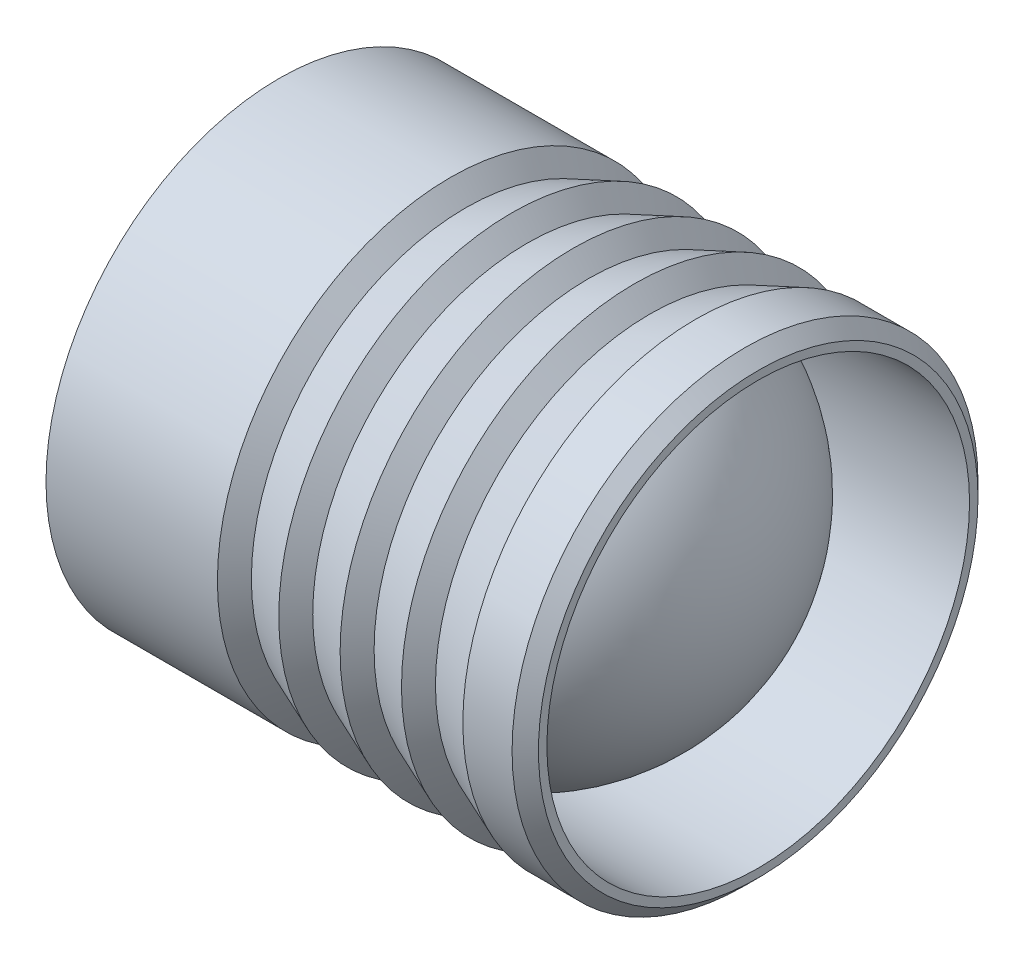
ISO-10303-21;
HEADER;
FILE_DESCRIPTION(('STEP AP214'),'2;1');
FILE_NAME('part.step','',(''),(''),'','','');
FILE_SCHEMA(('AUTOMOTIVE_DESIGN { 1 0 10303 214 1 1 1 1 }'));
ENDSEC;
DATA;
#1=APPLICATION_CONTEXT('core data for automotive mechanical design processes');
#2=APPLICATION_PROTOCOL_DEFINITION('international standard','automotive_design',2000,#1);
#3=PRODUCT_CONTEXT('',#1,'mechanical');
#4=PRODUCT('Part','Part','',(#3));
#5=PRODUCT_RELATED_PRODUCT_CATEGORY('part','',(#4));
#6=PRODUCT_DEFINITION_FORMATION('','',#4);
#7=PRODUCT_DEFINITION_CONTEXT('part definition',#1,'design');
#8=PRODUCT_DEFINITION('design','',#6,#7);
#9=PRODUCT_DEFINITION_SHAPE('','',#8);
#10=(LENGTH_UNIT() NAMED_UNIT(*) SI_UNIT(.MILLI.,.METRE.));
#11=(NAMED_UNIT(*) PLANE_ANGLE_UNIT() SI_UNIT($,.RADIAN.));
#12=(NAMED_UNIT(*) SI_UNIT($,.STERADIAN.) SOLID_ANGLE_UNIT());
#13=UNCERTAINTY_MEASURE_WITH_UNIT(LENGTH_MEASURE(1.E-05),#10,'distance_accuracy_value','');
#14=(GEOMETRIC_REPRESENTATION_CONTEXT(3) GLOBAL_UNCERTAINTY_ASSIGNED_CONTEXT((#13)) GLOBAL_UNIT_ASSIGNED_CONTEXT((#10,
#11,#12)) REPRESENTATION_CONTEXT('',''));
#15=CARTESIAN_POINT('',(0.,0.,0.));
#16=DIRECTION('',(0.,0.,1.));
#17=DIRECTION('',(1.,0.,0.));
#18=AXIS2_PLACEMENT_3D('',#15,#16,#17);
#19=CARTESIAN_POINT('',(8.24,0.,0.));
#20=DIRECTION('',(1.,0.,0.));
#21=DIRECTION('',(0.,1.,0.));
#22=AXIS2_PLACEMENT_3D('',#19,#20,#21);
#23=SPHERICAL_SURFACE('',#22,6.36);
#24=CARTESIAN_POINT('',(8.59651265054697,0.,0.));
#25=DIRECTION('',(-1.,0.,0.));
#26=DIRECTION('',(0.,0.,1.));
#27=AXIS2_PLACEMENT_3D('',#24,#25,#26);
#28=CIRCLE('',#27,6.3499999);
#29=CARTESIAN_POINT('',(8.59651265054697,0.,6.3499999));
#30=VERTEX_POINT('',#29);
#31=EDGE_CURVE('E41',#30,#30,#28,.T.);
#32=ORIENTED_EDGE('',*,*,#31,.F.);
#33=EDGE_LOOP('',(#32));
#34=FACE_BOUND('',#33,.T.);
#35=CARTESIAN_POINT('',(14.6,0.,0.));
#36=VERTEX_POINT('',#35);
#37=VERTEX_LOOP('',#36);
#38=FACE_BOUND('',#37,.T.);
#39=ADVANCED_FACE('F18',(#34,#38),#23,.T.);
#40=CARTESIAN_POINT('',(15.,6.60402020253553,0.));
#41=DIRECTION('',(-1.,0.,0.));
#42=DIRECTION('',(0.,0.,1.));
#43=AXIS2_PLACEMENT_3D('',#40,#41,#42);
#44=PLANE('',#43);
#45=CARTESIAN_POINT('',(15.,0.,0.));
#46=DIRECTION('',(1.,0.,0.));
#47=DIRECTION('',(0.,0.,-1.));
#48=AXIS2_PLACEMENT_3D('',#45,#46,#47);
#49=CIRCLE('',#48,6.6040202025);
#50=CARTESIAN_POINT('',(15.,0.,-6.60402020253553));
#51=VERTEX_POINT('',#50);
#52=EDGE_CURVE('E11',#51,#51,#49,.T.);
#53=ORIENTED_EDGE('',*,*,#52,.T.);
#54=EDGE_LOOP('',(#53));
#55=FACE_BOUND('',#54,.T.);
#56=CARTESIAN_POINT('',(15.,0.,0.));
#57=DIRECTION('',(1.,0.,0.));
#58=DIRECTION('',(0.,0.,-1.));
#59=AXIS2_PLACEMENT_3D('',#56,#57,#58);
#60=CIRCLE('',#59,6.3499999);
#61=CARTESIAN_POINT('',(15.,0.,-6.34999989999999));
#62=VERTEX_POINT('',#61);
#63=EDGE_CURVE('E29',#62,#62,#60,.T.);
#64=ORIENTED_EDGE('',*,*,#63,.F.);
#65=EDGE_LOOP('',(#64));
#66=FACE_BOUND('',#65,.T.);
#67=ADVANCED_FACE('F172',(#55,#66),#44,.F.);
#68=CARTESIAN_POINT('',(15.,0.,0.));
#69=DIRECTION('',(-1.,0.,0.));
#70=DIRECTION('',(0.,0.,-1.));
#71=AXIS2_PLACEMENT_3D('',#68,#69,#70);
#72=CYLINDRICAL_SURFACE('',#71,6.3499999);
#73=ORIENTED_EDGE('',*,*,#63,.T.);
#74=EDGE_LOOP('',(#73));
#75=FACE_BOUND('',#74,.T.);
#76=ORIENTED_EDGE('',*,*,#31,.T.);
#77=EDGE_LOOP('',(#76));
#78=FACE_BOUND('',#77,.T.);
#79=ADVANCED_FACE('F169',(#75,#78),#72,.F.);
#80=CARTESIAN_POINT('',(0.,0.,0.));
#81=DIRECTION('',(1.,0.,0.));
#82=DIRECTION('',(0.,1.,0.));
#83=AXIS2_PLACEMENT_3D('',#80,#81,#82);
#84=PLANE('',#83);
#85=CARTESIAN_POINT('',(0.,0.,0.));
#86=DIRECTION('',(1.,0.,0.));
#87=DIRECTION('',(0.,0.,-1.));
#88=AXIS2_PLACEMENT_3D('',#85,#86,#87);
#89=CIRCLE('',#88,5.9607695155);
#90=CARTESIAN_POINT('',(0.,0.,-5.96076951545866));
#91=VERTEX_POINT('',#90);
#92=EDGE_CURVE('E22',#91,#91,#89,.T.);
#93=ORIENTED_EDGE('',*,*,#92,.F.);
#94=EDGE_LOOP('',(#93));
#95=FACE_BOUND('',#94,.T.);
#96=ADVANCED_FACE('F171',(#95),#84,.F.);
#97=CARTESIAN_POINT('',(14.6040202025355,0.,0.));
#98=DIRECTION('',(-1.,0.,0.));
#99=DIRECTION('',(0.,0.,1.));
#100=AXIS2_PLACEMENT_3D('',#97,#98,#99);
#101=CONICAL_SURFACE('',#100,7.,0.7853981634);
#102=CARTESIAN_POINT('',(14.6040202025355,0.,0.));
#103=DIRECTION('',(1.,0.,0.));
#104=DIRECTION('',(0.,0.,-1.));
#105=AXIS2_PLACEMENT_3D('',#102,#103,#104);
#106=CIRCLE('',#105,7.);
#107=CARTESIAN_POINT('',(14.6040202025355,0.,-7.));
#108=VERTEX_POINT('',#107);
#109=EDGE_CURVE('E112',#108,#108,#106,.T.);
#110=ORIENTED_EDGE('',*,*,#109,.T.);
#111=EDGE_LOOP('',(#110));
#112=FACE_BOUND('',#111,.T.);
#113=ORIENTED_EDGE('',*,*,#52,.F.);
#114=EDGE_LOOP('',(#113));
#115=FACE_BOUND('',#114,.T.);
#116=ADVANCED_FACE('F180',(#112,#115),#101,.T.);
#117=CARTESIAN_POINT('',(15.,0.,0.));
#118=DIRECTION('',(-1.,0.,0.));
#119=DIRECTION('',(0.,0.,-1.));
#120=AXIS2_PLACEMENT_3D('',#117,#118,#119);
#121=CYLINDRICAL_SURFACE('',#120,7.);
#122=CARTESIAN_POINT('',(13.125,0.,0.));
#123=DIRECTION('',(1.,0.,0.));
#124=DIRECTION('',(0.,0.,-1.));
#125=AXIS2_PLACEMENT_3D('',#122,#123,#124);
#126=CIRCLE('',#125,7.);
#127=CARTESIAN_POINT('',(13.125,0.,-7.));
#128=VERTEX_POINT('',#127);
#129=EDGE_CURVE('E107',#128,#128,#126,.T.);
#130=ORIENTED_EDGE('',*,*,#129,.T.);
#131=EDGE_LOOP('',(#130));
#132=FACE_BOUND('',#131,.T.);
#133=ORIENTED_EDGE('',*,*,#109,.F.);
#134=EDGE_LOOP('',(#133));
#135=FACE_BOUND('',#134,.T.);
#136=ADVANCED_FACE('F209',(#132,#135),#121,.T.);
#137=CARTESIAN_POINT('',(11.7421875,0.,0.));
#138=DIRECTION('',(1.,0.,0.));
#139=DIRECTION('',(0.,0.,-1.));
#140=AXIS2_PLACEMENT_3D('',#137,#138,#139);
#141=CONICAL_SURFACE('',#140,6.44,0.3847850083);
#142=ORIENTED_EDGE('',*,*,#129,.F.);
#143=EDGE_LOOP('',(#142));
#144=FACE_BOUND('',#143,.T.);
#145=CARTESIAN_POINT('',(11.7421875,0.,0.));
#146=DIRECTION('',(1.,0.,0.));
#147=DIRECTION('',(0.,0.,-1.));
#148=AXIS2_PLACEMENT_3D('',#145,#146,#147);
#149=CIRCLE('',#148,6.44);
#150=CARTESIAN_POINT('',(11.7421875,0.,-6.44));
#151=VERTEX_POINT('',#150);
#152=EDGE_CURVE('E113',#151,#151,#149,.T.);
#153=ORIENTED_EDGE('',*,*,#152,.T.);
#154=EDGE_LOOP('',(#153));
#155=FACE_BOUND('',#154,.T.);
#156=ADVANCED_FACE('F108',(#144,#155),#141,.T.);
#157=CARTESIAN_POINT('',(11.28125,0.,0.));
#158=DIRECTION('',(-1.,0.,0.));
#159=DIRECTION('',(0.,0.,1.));
#160=AXIS2_PLACEMENT_3D('',#157,#158,#159);
#161=CONICAL_SURFACE('',#160,7.,0.882126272);
#162=CARTESIAN_POINT('',(11.28125,0.,0.));
#163=DIRECTION('',(1.,0.,0.));
#164=DIRECTION('',(0.,0.,-1.));
#165=AXIS2_PLACEMENT_3D('',#162,#163,#164);
#166=CIRCLE('',#165,7.);
#167=CARTESIAN_POINT('',(11.28125,0.,-7.));
#168=VERTEX_POINT('',#167);
#169=EDGE_CURVE('E121',#168,#168,#166,.T.);
#170=ORIENTED_EDGE('',*,*,#169,.T.);
#171=EDGE_LOOP('',(#170));
#172=FACE_BOUND('',#171,.T.);
#173=ORIENTED_EDGE('',*,*,#152,.F.);
#174=EDGE_LOOP('',(#173));
#175=FACE_BOUND('',#174,.T.);
#176=ADVANCED_FACE('F208',(#172,#175),#161,.T.);
#177=CARTESIAN_POINT('',(9.8984375,0.,0.));
#178=DIRECTION('',(1.,0.,0.));
#179=DIRECTION('',(0.,0.,-1.));
#180=AXIS2_PLACEMENT_3D('',#177,#178,#179);
#181=CONICAL_SURFACE('',#180,6.44,0.3847850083);
#182=ORIENTED_EDGE('',*,*,#169,.F.);
#183=EDGE_LOOP('',(#182));
#184=FACE_BOUND('',#183,.T.);
#185=CARTESIAN_POINT('',(9.8984375,0.,0.));
#186=DIRECTION('',(1.,0.,0.));
#187=DIRECTION('',(0.,0.,-1.));
#188=AXIS2_PLACEMENT_3D('',#185,#186,#187);
#189=CIRCLE('',#188,6.44);
#190=CARTESIAN_POINT('',(9.8984375,0.,-6.44));
#191=VERTEX_POINT('',#190);
#192=EDGE_CURVE('E143',#191,#191,#189,.T.);
#193=ORIENTED_EDGE('',*,*,#192,.T.);
#194=EDGE_LOOP('',(#193));
#195=FACE_BOUND('',#194,.T.);
#196=ADVANCED_FACE('F199',(#184,#195),#181,.T.);
#197=CARTESIAN_POINT('',(9.4375,0.,0.));
#198=DIRECTION('',(-1.,0.,0.));
#199=DIRECTION('',(0.,0.,1.));
#200=AXIS2_PLACEMENT_3D('',#197,#198,#199);
#201=CONICAL_SURFACE('',#200,7.,0.882126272);
#202=CARTESIAN_POINT('',(9.4375,0.,0.));
#203=DIRECTION('',(1.,0.,0.));
#204=DIRECTION('',(0.,0.,-1.));
#205=AXIS2_PLACEMENT_3D('',#202,#203,#204);
#206=CIRCLE('',#205,7.);
#207=CARTESIAN_POINT('',(9.4375,0.,-7.));
#208=VERTEX_POINT('',#207);
#209=EDGE_CURVE('E128',#208,#208,#206,.T.);
#210=ORIENTED_EDGE('',*,*,#209,.T.);
#211=EDGE_LOOP('',(#210));
#212=FACE_BOUND('',#211,.T.);
#213=ORIENTED_EDGE('',*,*,#192,.F.);
#214=EDGE_LOOP('',(#213));
#215=FACE_BOUND('',#214,.T.);
#216=ADVANCED_FACE('F195',(#212,#215),#201,.T.);
#217=CARTESIAN_POINT('',(8.0546875,0.,0.));
#218=DIRECTION('',(1.,0.,0.));
#219=DIRECTION('',(0.,0.,-1.));
#220=AXIS2_PLACEMENT_3D('',#217,#218,#219);
#221=CONICAL_SURFACE('',#220,6.44,0.3847850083);
#222=ORIENTED_EDGE('',*,*,#209,.F.);
#223=EDGE_LOOP('',(#222));
#224=FACE_BOUND('',#223,.T.);
#225=CARTESIAN_POINT('',(8.0546875,0.,0.));
#226=DIRECTION('',(1.,0.,0.));
#227=DIRECTION('',(0.,0.,-1.));
#228=AXIS2_PLACEMENT_3D('',#225,#226,#227);
#229=CIRCLE('',#228,6.44);
#230=CARTESIAN_POINT('',(8.0546875,0.,-6.44));
#231=VERTEX_POINT('',#230);
#232=EDGE_CURVE('E124',#231,#231,#229,.T.);
#233=ORIENTED_EDGE('',*,*,#232,.T.);
#234=EDGE_LOOP('',(#233));
#235=FACE_BOUND('',#234,.T.);
#236=ADVANCED_FACE('F198',(#224,#235),#221,.T.);
#237=CARTESIAN_POINT('',(7.59375,0.,0.));
#238=DIRECTION('',(-1.,0.,0.));
#239=DIRECTION('',(0.,0.,1.));
#240=AXIS2_PLACEMENT_3D('',#237,#238,#239);
#241=CONICAL_SURFACE('',#240,7.,0.882126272);
#242=CARTESIAN_POINT('',(7.59375,0.,0.));
#243=DIRECTION('',(1.,0.,0.));
#244=DIRECTION('',(0.,0.,-1.));
#245=AXIS2_PLACEMENT_3D('',#242,#243,#244);
#246=CIRCLE('',#245,7.);
#247=CARTESIAN_POINT('',(7.59375,0.,-7.));
#248=VERTEX_POINT('',#247);
#249=EDGE_CURVE('E129',#248,#248,#246,.T.);
#250=ORIENTED_EDGE('',*,*,#249,.T.);
#251=EDGE_LOOP('',(#250));
#252=FACE_BOUND('',#251,.T.);
#253=ORIENTED_EDGE('',*,*,#232,.F.);
#254=EDGE_LOOP('',(#253));
#255=FACE_BOUND('',#254,.T.);
#256=ADVANCED_FACE('F223',(#252,#255),#241,.T.);
#257=CARTESIAN_POINT('',(6.2109375,0.,0.));
#258=DIRECTION('',(1.,0.,0.));
#259=DIRECTION('',(0.,0.,-1.));
#260=AXIS2_PLACEMENT_3D('',#257,#258,#259);
#261=CONICAL_SURFACE('',#260,6.44,0.3847850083);
#262=ORIENTED_EDGE('',*,*,#249,.F.);
#263=EDGE_LOOP('',(#262));
#264=FACE_BOUND('',#263,.T.);
#265=CARTESIAN_POINT('',(6.2109375,0.,0.));
#266=DIRECTION('',(1.,0.,0.));
#267=DIRECTION('',(0.,0.,-1.));
#268=AXIS2_PLACEMENT_3D('',#265,#266,#267);
#269=CIRCLE('',#268,6.44);
#270=CARTESIAN_POINT('',(6.2109375,0.,-6.44));
#271=VERTEX_POINT('',#270);
#272=EDGE_CURVE('E147',#271,#271,#269,.T.);
#273=ORIENTED_EDGE('',*,*,#272,.T.);
#274=EDGE_LOOP('',(#273));
#275=FACE_BOUND('',#274,.T.);
#276=ADVANCED_FACE('F205',(#264,#275),#261,.T.);
#277=CARTESIAN_POINT('',(5.75,0.,0.));
#278=DIRECTION('',(-1.,0.,0.));
#279=DIRECTION('',(0.,0.,1.));
#280=AXIS2_PLACEMENT_3D('',#277,#278,#279);
#281=CONICAL_SURFACE('',#280,7.,0.882126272);
#282=CARTESIAN_POINT('',(5.75,0.,0.));
#283=DIRECTION('',(1.,0.,0.));
#284=DIRECTION('',(0.,0.,-1.));
#285=AXIS2_PLACEMENT_3D('',#282,#283,#284);
#286=CIRCLE('',#285,7.);
#287=CARTESIAN_POINT('',(5.75,0.,-7.));
#288=VERTEX_POINT('',#287);
#289=EDGE_CURVE('E133',#288,#288,#286,.T.);
#290=ORIENTED_EDGE('',*,*,#289,.T.);
#291=EDGE_LOOP('',(#290));
#292=FACE_BOUND('',#291,.T.);
#293=ORIENTED_EDGE('',*,*,#272,.F.);
#294=EDGE_LOOP('',(#293));
#295=FACE_BOUND('',#294,.T.);
#296=ADVANCED_FACE('F201',(#292,#295),#281,.T.);
#297=CARTESIAN_POINT('',(15.,0.,0.));
#298=DIRECTION('',(-1.,0.,0.));
#299=DIRECTION('',(0.,0.,-1.));
#300=AXIS2_PLACEMENT_3D('',#297,#298,#299);
#301=CYLINDRICAL_SURFACE('',#300,7.);
#302=CARTESIAN_POINT('',(0.6,0.,0.));
#303=DIRECTION('',(1.,0.,0.));
#304=DIRECTION('',(0.,0.,-1.));
#305=AXIS2_PLACEMENT_3D('',#302,#303,#304);
#306=CIRCLE('',#305,7.);
#307=CARTESIAN_POINT('',(0.6,0.,-7.));
#308=VERTEX_POINT('',#307);
#309=EDGE_CURVE('E130',#308,#308,#306,.T.);
#310=ORIENTED_EDGE('',*,*,#309,.T.);
#311=EDGE_LOOP('',(#310));
#312=FACE_BOUND('',#311,.T.);
#313=ORIENTED_EDGE('',*,*,#289,.F.);
#314=EDGE_LOOP('',(#313));
#315=FACE_BOUND('',#314,.T.);
#316=ADVANCED_FACE('F204',(#312,#315),#301,.T.);
#317=CARTESIAN_POINT('',(0.,0.,0.));
#318=DIRECTION('',(1.,0.,0.));
#319=DIRECTION('',(0.,0.,-1.));
#320=AXIS2_PLACEMENT_3D('',#317,#318,#319);
#321=CONICAL_SURFACE('',#320,5.9607695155,1.0471975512);
#322=ORIENTED_EDGE('',*,*,#309,.F.);
#323=EDGE_LOOP('',(#322));
#324=FACE_BOUND('',#323,.T.);
#325=ORIENTED_EDGE('',*,*,#92,.T.);
#326=EDGE_LOOP('',(#325));
#327=FACE_BOUND('',#326,.T.);
#328=ADVANCED_FACE('F211',(#324,#327),#321,.T.);
#329=CLOSED_SHELL('',(#39,#67,#79,#96,#116,#136,#156,#176,#196,#216,#236,#256,#276,#296,#316,#328));
#330=CARTESIAN_POINT('',(4.41617415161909,0.,0.));
#331=DIRECTION('',(1.,0.,0.));
#332=DIRECTION('',(0.,0.,-1.));
#333=AXIS2_PLACEMENT_3D('',#330,#331,#332);
#334=CONICAL_SURFACE('',#333,6.3499999,1.0471975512);
#335=CARTESIAN_POINT('',(4.41617415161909,0.,0.));
#336=DIRECTION('',(1.,0.,0.));
#337=DIRECTION('',(0.,0.,-1.));
#338=AXIS2_PLACEMENT_3D('',#335,#336,#337);
#339=CIRCLE('',#338,6.3499999);
#340=CARTESIAN_POINT('',(4.41617415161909,0.,-6.3499999));
#341=VERTEX_POINT('',#340);
#342=EDGE_CURVE('E135',#341,#341,#339,.T.);
#343=ORIENTED_EDGE('',*,*,#342,.T.);
#344=EDGE_LOOP('',(#343));
#345=FACE_BOUND('',#344,.T.);
#346=CARTESIAN_POINT('',(0.75,0.,0.));
#347=VERTEX_POINT('',#346);
#348=VERTEX_LOOP('',#347);
#349=FACE_BOUND('',#348,.T.);
#350=ADVANCED_FACE('F20',(#345,#349),#334,.F.);
#351=CARTESIAN_POINT('',(8.24,0.,0.));
#352=DIRECTION('',(1.,0.,0.));
#353=DIRECTION('',(0.,1.,0.));
#354=AXIS2_PLACEMENT_3D('',#351,#352,#353);
#355=SPHERICAL_SURFACE('',#354,6.36);
#356=CARTESIAN_POINT('',(7.88348734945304,0.,0.));
#357=DIRECTION('',(1.,0.,0.));
#358=DIRECTION('',(0.,0.,-1.));
#359=AXIS2_PLACEMENT_3D('',#356,#357,#358);
#360=CIRCLE('',#359,6.3499999);
#361=CARTESIAN_POINT('',(7.88348734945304,0.,-6.3499999));
#362=VERTEX_POINT('',#361);
#363=EDGE_CURVE('E139',#362,#362,#360,.T.);
#364=ORIENTED_EDGE('',*,*,#363,.F.);
#365=EDGE_LOOP('',(#364));
#366=FACE_BOUND('',#365,.T.);
#367=CARTESIAN_POINT('',(1.88,0.,0.));
#368=VERTEX_POINT('',#367);
#369=VERTEX_LOOP('',#368);
#370=FACE_BOUND('',#369,.T.);
#371=ADVANCED_FACE('F193',(#366,#370),#355,.T.);
#372=CARTESIAN_POINT('',(15.,0.,0.));
#373=DIRECTION('',(-1.,0.,0.));
#374=DIRECTION('',(0.,0.,-1.));
#375=AXIS2_PLACEMENT_3D('',#372,#373,#374);
#376=CYLINDRICAL_SURFACE('',#375,6.3499999);
#377=ORIENTED_EDGE('',*,*,#363,.T.);
#378=EDGE_LOOP('',(#377));
#379=FACE_BOUND('',#378,.T.);
#380=ORIENTED_EDGE('',*,*,#342,.F.);
#381=EDGE_LOOP('',(#380));
#382=FACE_BOUND('',#381,.T.);
#383=ADVANCED_FACE('F236',(#379,#382),#376,.F.);
#384=CLOSED_SHELL('',(#350,#371,#383));
#385=ORIENTED_CLOSED_SHELL('',*,#384,.T.);
#386=BREP_WITH_VOIDS('B1',#329,(#385));
#387=ADVANCED_BREP_SHAPE_REPRESENTATION('',(#18,#386),#14);
#388=SHAPE_DEFINITION_REPRESENTATION(#9,#387);
ENDSEC;
END-ISO-10303-21;
